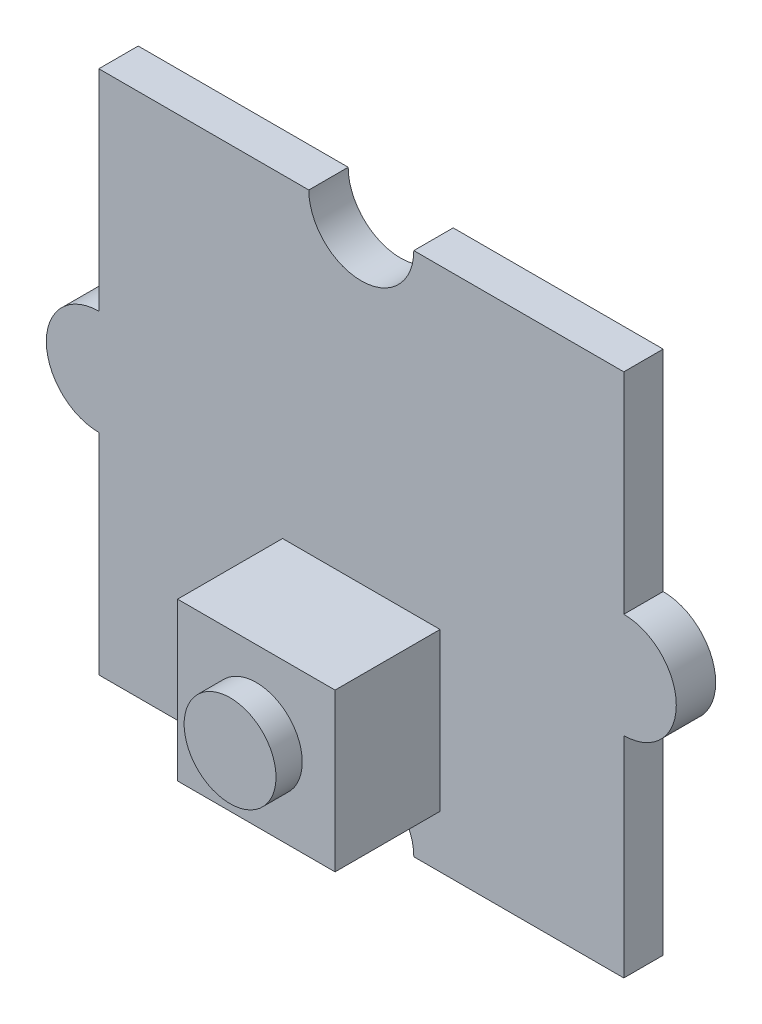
from build123d import *

# Parameters (mm, degrees)
BOSS_EXTRU_1_DEPTH      = 1.5
ESQUISSE2_W             = 6
ESQUISSE2_H             = 6
BOSS_EXTRU_2_DEPTH      = 4
ESQUISSE3_R             = 1.75
BOSS_EXTRU_3_DEPTH      = 1
ESQUISSE4_R             = 2
ENL_V_MAT_EXTRU_1_DEPTH = 1.5


with BuildPart() as part:
    # Esquisse1 → Boss.-Extru.1 (new body)
    with BuildSketch(Plane.XY):
        with BuildLine():
            Line((0, 12), (0, 20))
            Line((0, 20), (20, 20))
            Line((20, 20), (20, 12))
            ThreePointArc((20, 12), (22, 10), (20, 8))
            Line((20, 8), (20, 0))
            Line((20, 0), (0, 0))
            Line((0, 0), (0, 8))
            ThreePointArc((0, 8), (-2, 10), (0, 12))
        make_face()
    extrude(amount=BOSS_EXTRU_1_DEPTH)

    # Esquisse2 → Boss.-Extru.2 (add)
    with BuildSketch(Plane.XY.offset(1.5)):
        with Locations((10, 5)):
            Rectangle(ESQUISSE2_W, ESQUISSE2_H)
    extrude(amount=BOSS_EXTRU_2_DEPTH)

    # Esquisse3 → Boss.-Extru.3 (add)
    with BuildSketch(Plane.XY.offset(5.5)):
        with Locations((10, 5)):
            Circle(ESQUISSE3_R)
    extrude(amount=BOSS_EXTRU_3_DEPTH)

    # Esquisse4 → Enl_v. mat.-Extru.1 (cut)
    with BuildSketch(Plane.XY.offset(1.5)):
        with Locations((10, 20)):
            Circle(ESQUISSE4_R)
        with Locations((10, 0)):
            Circle(ESQUISSE4_R)
    extrude(amount=-ENL_V_MAT_EXTRU_1_DEPTH, mode=Mode.SUBTRACT)


solid = part.part
